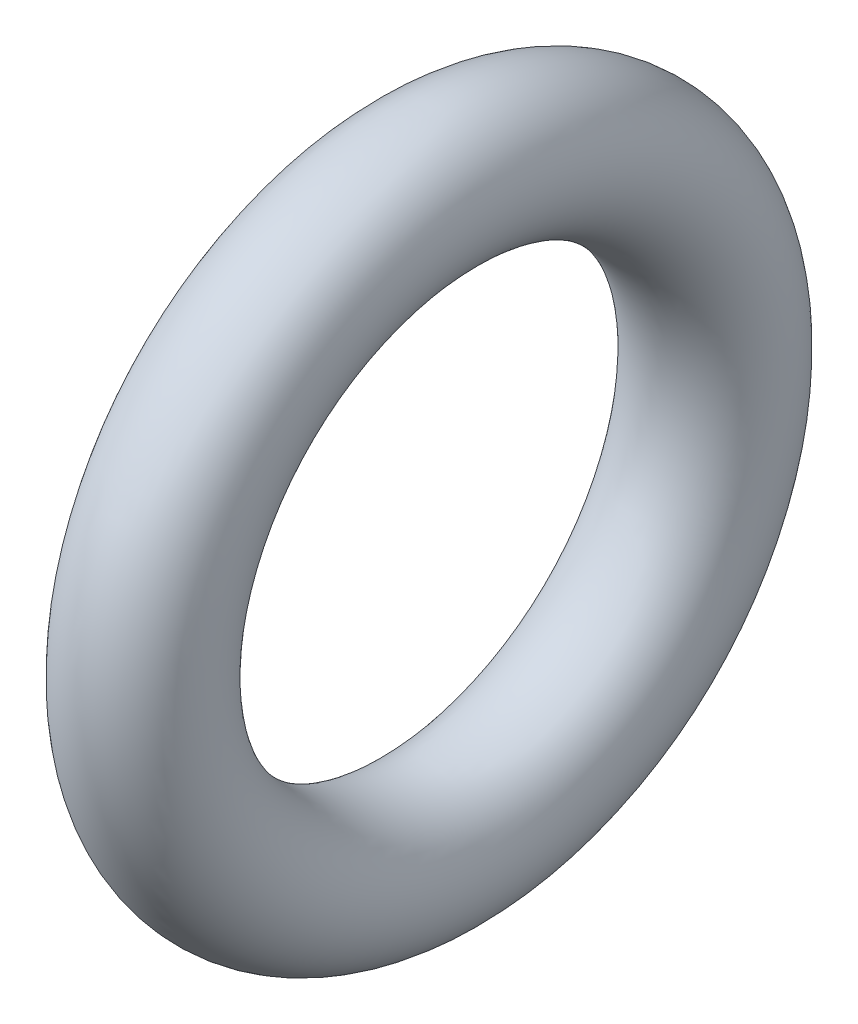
ISO-10303-21;
HEADER;
FILE_DESCRIPTION(('STEP AP214'),'2;1');
FILE_NAME('part.step','',(''),(''),'','','');
FILE_SCHEMA(('AUTOMOTIVE_DESIGN { 1 0 10303 214 1 1 1 1 }'));
ENDSEC;
DATA;
#1=APPLICATION_CONTEXT('core data for automotive mechanical design processes');
#2=APPLICATION_PROTOCOL_DEFINITION('international standard','automotive_design',2000,#1);
#3=PRODUCT_CONTEXT('',#1,'mechanical');
#4=PRODUCT('Part','Part','',(#3));
#5=PRODUCT_RELATED_PRODUCT_CATEGORY('part','',(#4));
#6=PRODUCT_DEFINITION_FORMATION('','',#4);
#7=PRODUCT_DEFINITION_CONTEXT('part definition',#1,'design');
#8=PRODUCT_DEFINITION('design','',#6,#7);
#9=PRODUCT_DEFINITION_SHAPE('','',#8);
#10=(LENGTH_UNIT() NAMED_UNIT(*) SI_UNIT(.MILLI.,.METRE.));
#11=(NAMED_UNIT(*) PLANE_ANGLE_UNIT() SI_UNIT($,.RADIAN.));
#12=(NAMED_UNIT(*) SI_UNIT($,.STERADIAN.) SOLID_ANGLE_UNIT());
#13=UNCERTAINTY_MEASURE_WITH_UNIT(LENGTH_MEASURE(1.E-05),#10,'distance_accuracy_value','');
#14=(GEOMETRIC_REPRESENTATION_CONTEXT(3) GLOBAL_UNCERTAINTY_ASSIGNED_CONTEXT((#13)) GLOBAL_UNIT_ASSIGNED_CONTEXT((#10,
#11,#12)) REPRESENTATION_CONTEXT('',''));
#15=CARTESIAN_POINT('',(0.,0.,0.));
#16=DIRECTION('',(0.,0.,1.));
#17=DIRECTION('',(1.,0.,0.));
#18=AXIS2_PLACEMENT_3D('',#15,#16,#17);
#19=CARTESIAN_POINT('',(5.5,0.,0.));
#20=DIRECTION('',(1.,0.,0.));
#21=DIRECTION('',(0.,-1.,0.));
#22=AXIS2_PLACEMENT_3D('',#19,#20,#21);
#23=TOROIDAL_SURFACE('',#22,12.5,3.);
#24=CARTESIAN_POINT('',(5.5,-15.5,0.));
#25=VERTEX_POINT('',#24);
#26=VERTEX_LOOP('',#25);
#27=FACE_BOUND('',#26,.T.);
#28=ADVANCED_FACE('F26',(#27),#23,.T.);
#29=CLOSED_SHELL('',(#28));
#30=MANIFOLD_SOLID_BREP('B2',#29);
#31=ADVANCED_BREP_SHAPE_REPRESENTATION('',(#18,#30),#14);
#32=SHAPE_DEFINITION_REPRESENTATION(#9,#31);
ENDSEC;
END-ISO-10303-21;
